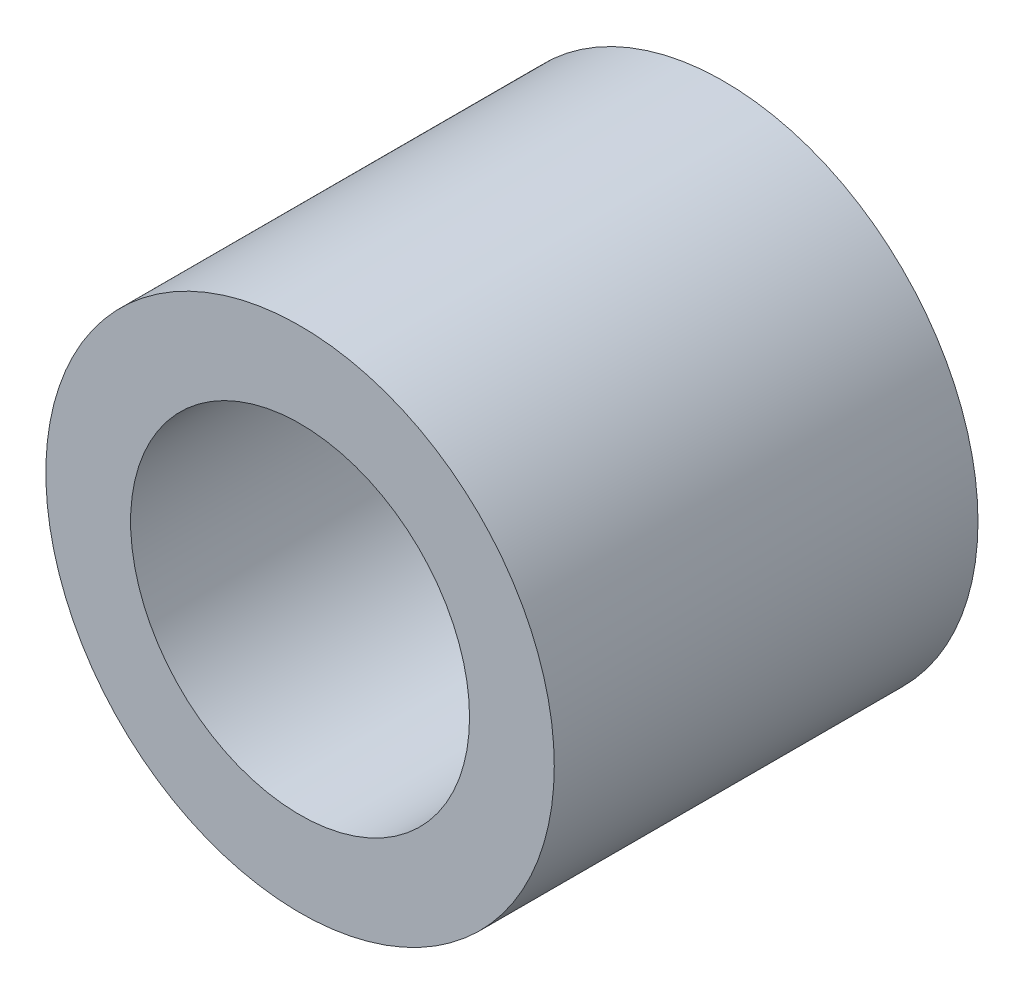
from build123d import *

# Parameters (mm, degrees)
ESQUISSE1_R        = 45
ESQUISSE1_R_2      = 30
BOSS_EXTRU_1_DEPTH = 75


with BuildPart() as part:
    # Esquisse1 → Boss.-Extru.1 (new body)
    with BuildSketch(Plane.XY):
        Circle(ESQUISSE1_R)
        Circle(ESQUISSE1_R_2, mode=Mode.SUBTRACT)
    extrude(amount=BOSS_EXTRU_1_DEPTH)


solid = part.part
